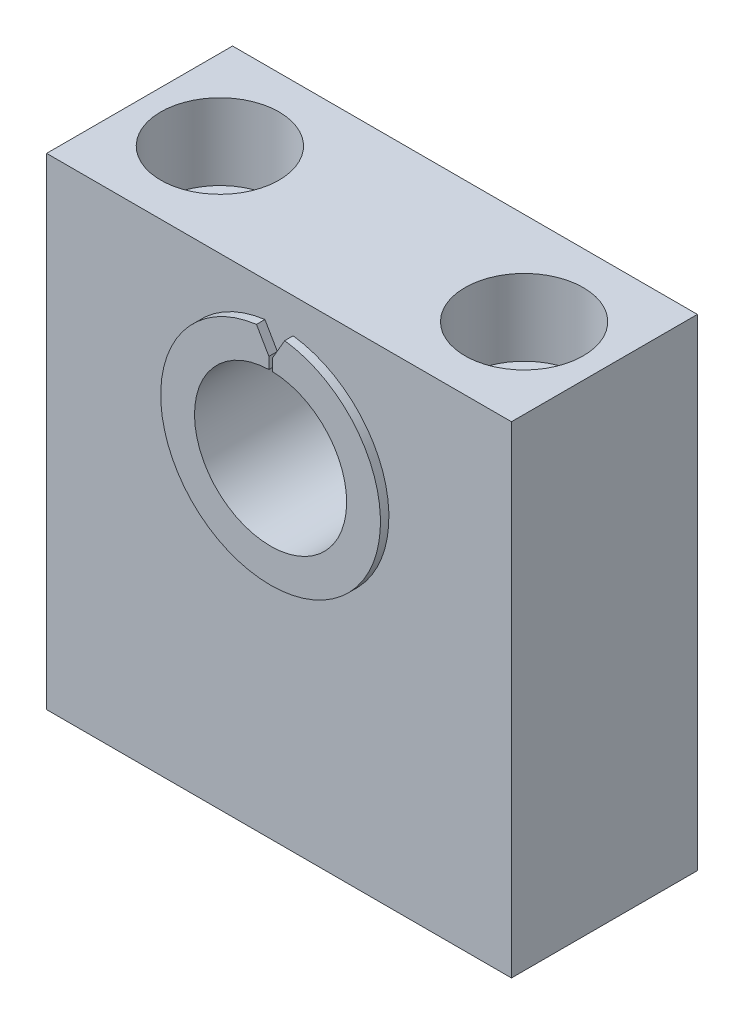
ISO-10303-21;
HEADER;
FILE_DESCRIPTION(('STEP AP214'),'2;1');
FILE_NAME('part.step','',(''),(''),'','','');
FILE_SCHEMA(('AUTOMOTIVE_DESIGN { 1 0 10303 214 1 1 1 1 }'));
ENDSEC;
DATA;
#1=APPLICATION_CONTEXT('core data for automotive mechanical design processes');
#2=APPLICATION_PROTOCOL_DEFINITION('international standard','automotive_design',2000,#1);
#3=PRODUCT_CONTEXT('',#1,'mechanical');
#4=PRODUCT('Part','Part','',(#3));
#5=PRODUCT_RELATED_PRODUCT_CATEGORY('part','',(#4));
#6=PRODUCT_DEFINITION_FORMATION('','',#4);
#7=PRODUCT_DEFINITION_CONTEXT('part definition',#1,'design');
#8=PRODUCT_DEFINITION('design','',#6,#7);
#9=PRODUCT_DEFINITION_SHAPE('','',#8);
#10=(LENGTH_UNIT() NAMED_UNIT(*) SI_UNIT(.MILLI.,.METRE.));
#11=(NAMED_UNIT(*) PLANE_ANGLE_UNIT() SI_UNIT($,.RADIAN.));
#12=(NAMED_UNIT(*) SI_UNIT($,.STERADIAN.) SOLID_ANGLE_UNIT());
#13=UNCERTAINTY_MEASURE_WITH_UNIT(LENGTH_MEASURE(1.E-05),#10,'distance_accuracy_value','');
#14=(GEOMETRIC_REPRESENTATION_CONTEXT(3) GLOBAL_UNCERTAINTY_ASSIGNED_CONTEXT((#13)) GLOBAL_UNIT_ASSIGNED_CONTEXT((#10,
#11,#12)) REPRESENTATION_CONTEXT('',''));
#15=CARTESIAN_POINT('',(0.,0.,0.));
#16=DIRECTION('',(0.,0.,1.));
#17=DIRECTION('',(1.,0.,0.));
#18=AXIS2_PLACEMENT_3D('',#15,#16,#17);
#19=CARTESIAN_POINT('',(0.,40.,-9.));
#20=DIRECTION('',(0.,0.,-1.));
#21=DIRECTION('',(0.,1.,0.));
#22=AXIS2_PLACEMENT_3D('',#19,#20,#21);
#23=CYLINDRICAL_SURFACE('',#22,9.);
#24=CARTESIAN_POINT('',(0.,40.,12.));
#25=DIRECTION('',(0.,0.,-1.));
#26=DIRECTION('',(1.,0.,0.));
#27=AXIS2_PLACEMENT_3D('',#24,#25,#26);
#28=CIRCLE('',#27,9.);
#29=CARTESIAN_POINT('',(0.200000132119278,48.9977775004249,12.));
#30=VERTEX_POINT('',#29);
#31=CARTESIAN_POINT('',(-0.200000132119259,48.9977775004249,12.));
#32=VERTEX_POINT('',#31);
#33=EDGE_CURVE('E289',#30,#32,#28,.T.);
#34=ORIENTED_EDGE('',*,*,#33,.F.);
#35=DIRECTION('',(0.,0.,1.));
#36=VECTOR('',#35,1.);
#37=CARTESIAN_POINT('',(0.20000000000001,48.9977775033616,-9.));
#38=LINE('',#37,#36);
#39=CARTESIAN_POINT('',(0.20000000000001,48.9977775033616,-9.));
#40=VERTEX_POINT('',#39);
#41=EDGE_CURVE('E322',#40,#30,#38,.T.);
#42=ORIENTED_EDGE('',*,*,#41,.F.);
#43=CARTESIAN_POINT('',(0.,40.,-9.));
#44=DIRECTION('',(0.,0.,-1.));
#45=DIRECTION('',(-1.,0.,0.));
#46=AXIS2_PLACEMENT_3D('',#43,#44,#45);
#47=CIRCLE('',#46,9.);
#48=CARTESIAN_POINT('',(-0.19999999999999,48.9977775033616,-9.));
#49=VERTEX_POINT('',#48);
#50=EDGE_CURVE('E377',#40,#49,#47,.T.);
#51=ORIENTED_EDGE('',*,*,#50,.T.);
#52=DIRECTION('',(0.,0.,-1.));
#53=VECTOR('',#52,1.);
#54=CARTESIAN_POINT('',(-0.19999999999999,48.9977775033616,-9.));
#55=LINE('',#54,#53);
#56=EDGE_CURVE('E320',#32,#49,#55,.T.);
#57=ORIENTED_EDGE('',*,*,#56,.F.);
#58=EDGE_LOOP('',(#34,#42,#51,#57));
#59=FACE_BOUND('',#58,.T.);
#60=ADVANCED_FACE('F14',(#59),#23,.F.);
#61=CARTESIAN_POINT('',(-0.199999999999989,50.346410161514,-9.));
#62=DIRECTION('',(-1.,0.,0.));
#63=DIRECTION('',(0.,0.,1.));
#64=AXIS2_PLACEMENT_3D('',#61,#62,#63);
#65=PLANE('',#64);
#66=DIRECTION('',(0.,0.,1.));
#67=VECTOR('',#66,1.);
#68=CARTESIAN_POINT('',(-0.199999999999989,49.99799979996,-9.));
#69=LINE('',#68,#67);
#70=CARTESIAN_POINT('',(-0.200000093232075,49.997999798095,-9.));
#71=VERTEX_POINT('',#70);
#72=CARTESIAN_POINT('',(-0.200000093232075,49.997999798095,11.));
#73=VERTEX_POINT('',#72);
#74=EDGE_CURVE('E221',#71,#73,#69,.T.);
#75=ORIENTED_EDGE('',*,*,#74,.T.);
#76=DIRECTION('',(-2.67592747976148E-07,-0.999999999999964,0.));
#77=VECTOR('',#76,1.);
#78=CARTESIAN_POINT('',(-0.199999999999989,50.346410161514,11.));
#79=LINE('',#78,#77);
#80=CARTESIAN_POINT('',(-0.199999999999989,50.346410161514,11.));
#81=VERTEX_POINT('',#80);
#82=EDGE_CURVE('E234',#81,#73,#79,.T.);
#83=ORIENTED_EDGE('',*,*,#82,.F.);
#84=DIRECTION('',(0.,0.,1.));
#85=VECTOR('',#84,1.);
#86=CARTESIAN_POINT('',(-0.199999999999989,50.346410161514,-9.));
#87=LINE('',#86,#85);
#88=CARTESIAN_POINT('',(-0.199999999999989,50.346410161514,12.));
#89=VERTEX_POINT('',#88);
#90=EDGE_CURVE('E293',#81,#89,#87,.T.);
#91=ORIENTED_EDGE('',*,*,#90,.T.);
#92=DIRECTION('',(0.,-1.,0.));
#93=VECTOR('',#92,1.);
#94=CARTESIAN_POINT('',(-0.199999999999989,50.346410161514,12.));
#95=LINE('',#94,#93);
#96=CARTESIAN_POINT('',(-0.199999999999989,49.4978945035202,12.));
#97=VERTEX_POINT('',#96);
#98=EDGE_CURVE('E286',#89,#97,#95,.T.);
#99=ORIENTED_EDGE('',*,*,#98,.T.);
#100=DIRECTION('',(7.46907448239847E-09,1.,0.));
#101=VECTOR('',#100,1.);
#102=CARTESIAN_POINT('',(-0.200000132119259,48.9977775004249,12.));
#103=LINE('',#102,#101);
#104=EDGE_CURVE('E283',#32,#97,#103,.T.);
#105=ORIENTED_EDGE('',*,*,#104,.F.);
#106=ORIENTED_EDGE('',*,*,#56,.T.);
#107=DIRECTION('',(0.,-1.,0.));
#108=VECTOR('',#107,1.);
#109=CARTESIAN_POINT('',(-0.199999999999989,50.346410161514,-9.));
#110=LINE('',#109,#108);
#111=CARTESIAN_POINT('',(-0.199999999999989,49.8159775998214,-9.));
#112=VERTEX_POINT('',#111);
#113=EDGE_CURVE('E326',#112,#49,#110,.T.);
#114=ORIENTED_EDGE('',*,*,#113,.F.);
#115=DIRECTION('',(-8.4392815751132E-08,-1.,0.));
#116=VECTOR('',#115,1.);
#117=CARTESIAN_POINT('',(-0.200000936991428,40.0000000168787,-9.));
#118=LINE('',#117,#116);
#119=EDGE_CURVE('E312',#71,#112,#118,.T.);
#120=ORIENTED_EDGE('',*,*,#119,.F.);
#121=EDGE_LOOP('',(#75,#83,#91,#99,#105,#106,#114,#120));
#122=FACE_BOUND('',#121,.T.);
#123=ADVANCED_FACE('F154',(#122),#65,.F.);
#124=CARTESIAN_POINT('',(0.2,40.,-9.));
#125=DIRECTION('',(1.,0.,0.));
#126=DIRECTION('',(0.,0.,-1.));
#127=AXIS2_PLACEMENT_3D('',#124,#125,#126);
#128=PLANE('',#127);
#129=DIRECTION('',(-2.67592741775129E-07,0.999999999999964,0.));
#130=VECTOR('',#129,1.);
#131=CARTESIAN_POINT('',(0.200000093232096,49.997999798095,11.));
#132=LINE('',#131,#130);
#133=CARTESIAN_POINT('',(0.200000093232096,49.997999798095,11.));
#134=VERTEX_POINT('',#133);
#135=CARTESIAN_POINT('',(0.200000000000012,50.346410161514,11.));
#136=VERTEX_POINT('',#135);
#137=EDGE_CURVE('E231',#134,#136,#132,.T.);
#138=ORIENTED_EDGE('',*,*,#137,.F.);
#139=DIRECTION('',(0.,0.,-1.));
#140=VECTOR('',#139,1.);
#141=CARTESIAN_POINT('',(0.200000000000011,49.99799979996,-9.));
#142=LINE('',#141,#140);
#143=CARTESIAN_POINT('',(0.200000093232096,49.997999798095,-9.));
#144=VERTEX_POINT('',#143);
#145=EDGE_CURVE('E225',#134,#144,#142,.T.);
#146=ORIENTED_EDGE('',*,*,#145,.T.);
#147=DIRECTION('',(-8.43928127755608E-08,1.,0.));
#148=VECTOR('',#147,1.);
#149=CARTESIAN_POINT('',(0.20000093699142,40.0000000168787,-9.));
#150=LINE('',#149,#148);
#151=CARTESIAN_POINT('',(0.200000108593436,49.8159775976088,-9.));
#152=VERTEX_POINT('',#151);
#153=EDGE_CURVE('E380',#152,#144,#150,.T.);
#154=ORIENTED_EDGE('',*,*,#153,.F.);
#155=DIRECTION('',(0.,1.,0.));
#156=VECTOR('',#155,1.);
#157=CARTESIAN_POINT('',(0.2,40.,-9.));
#158=LINE('',#157,#156);
#159=EDGE_CURVE('E331',#40,#152,#158,.T.);
#160=ORIENTED_EDGE('',*,*,#159,.F.);
#161=ORIENTED_EDGE('',*,*,#41,.T.);
#162=DIRECTION('',(7.46908699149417E-09,-1.,0.));
#163=VECTOR('',#162,1.);
#164=CARTESIAN_POINT('',(0.20000012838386,49.4978945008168,12.));
#165=LINE('',#164,#163);
#166=CARTESIAN_POINT('',(0.200000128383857,49.4978945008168,12.));
#167=VERTEX_POINT('',#166);
#168=EDGE_CURVE('E290',#167,#30,#165,.T.);
#169=ORIENTED_EDGE('',*,*,#168,.F.);
#170=DIRECTION('',(0.,1.,0.));
#171=VECTOR('',#170,1.);
#172=CARTESIAN_POINT('',(0.2,40.,12.));
#173=LINE('',#172,#171);
#174=CARTESIAN_POINT('',(0.200000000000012,50.346410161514,12.));
#175=VERTEX_POINT('',#174);
#176=EDGE_CURVE('E24',#167,#175,#173,.T.);
#177=ORIENTED_EDGE('',*,*,#176,.T.);
#178=DIRECTION('',(0.,0.,1.));
#179=VECTOR('',#178,1.);
#180=CARTESIAN_POINT('',(0.200000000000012,50.346410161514,-9.));
#181=LINE('',#180,#179);
#182=EDGE_CURVE('E309',#136,#175,#181,.T.);
#183=ORIENTED_EDGE('',*,*,#182,.F.);
#184=EDGE_LOOP('',(#138,#146,#154,#160,#161,#169,#177,#183));
#185=FACE_BOUND('',#184,.T.);
#186=ADVANCED_FACE('F160',(#185),#128,.F.);
#187=CARTESIAN_POINT('',(0.,49.3,-9.));
#188=DIRECTION('',(0.,0.,-1.));
#189=DIRECTION('',(-1.,0.,0.));
#190=AXIS2_PLACEMENT_3D('',#187,#188,#189);
#191=PLANE('',#190);
#192=ORIENTED_EDGE('',*,*,#159,.T.);
#193=ORIENTED_EDGE('',*,*,#153,.T.);
#194=CARTESIAN_POINT('',(0.,40.,-9.));
#195=DIRECTION('',(0.,0.,-1.));
#196=DIRECTION('',(-1.,0.,0.));
#197=AXIS2_PLACEMENT_3D('',#194,#195,#196);
#198=CIRCLE('',#197,10.);
#199=EDGE_CURVE('E387',#144,#71,#198,.T.);
#200=ORIENTED_EDGE('',*,*,#199,.T.);
#201=ORIENTED_EDGE('',*,*,#119,.T.);
#202=ORIENTED_EDGE('',*,*,#113,.T.);
#203=ORIENTED_EDGE('',*,*,#50,.F.);
#204=EDGE_LOOP('',(#192,#193,#200,#201,#202,#203));
#205=FACE_BOUND('',#204,.T.);
#206=ADVANCED_FACE('F166',(#205),#191,.T.);
#207=CARTESIAN_POINT('',(-1.93984108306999,53.359903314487,-9.));
#208=DIRECTION('',(-0.866025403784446,-0.499999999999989,0.));
#209=DIRECTION('',(-0.499999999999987,0.866025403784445,0.));
#210=AXIS2_PLACEMENT_3D('',#207,#208,#209);
#211=PLANE('',#210);
#212=DIRECTION('',(0.499999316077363,-0.866025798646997,0.));
#213=VECTOR('',#212,1.);
#214=CARTESIAN_POINT('',(-0.286419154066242,50.4960928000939,11.));
#215=LINE('',#214,#213);
#216=CARTESIAN_POINT('',(-0.286419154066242,50.4960928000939,11.));
#217=VERTEX_POINT('',#216);
#218=EDGE_CURVE('E105',#217,#81,#215,.T.);
#219=ORIENTED_EDGE('',*,*,#218,.F.);
#220=DIRECTION('',(-0.499999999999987,0.866025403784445,0.));
#221=VECTOR('',#220,1.);
#222=CARTESIAN_POINT('',(-0.216506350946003,50.375,11.));
#223=LINE('',#222,#221);
#224=CARTESIAN_POINT('',(-1.66987298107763,52.8923048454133,11.));
#225=VERTEX_POINT('',#224);
#226=EDGE_CURVE('E342',#217,#225,#223,.T.);
#227=ORIENTED_EDGE('',*,*,#226,.T.);
#228=DIRECTION('',(0.,0.,1.));
#229=VECTOR('',#228,1.);
#230=CARTESIAN_POINT('',(-1.66987298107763,52.8923048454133,-9.));
#231=LINE('',#230,#229);
#232=CARTESIAN_POINT('',(-1.66987298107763,52.8923048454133,12.));
#233=VERTEX_POINT('',#232);
#234=EDGE_CURVE('E355',#225,#233,#231,.T.);
#235=ORIENTED_EDGE('',*,*,#234,.T.);
#236=DIRECTION('',(0.499999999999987,-0.866025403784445,0.));
#237=VECTOR('',#236,1.);
#238=CARTESIAN_POINT('',(-1.93984108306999,53.359903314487,12.));
#239=LINE('',#238,#237);
#240=EDGE_CURVE('E294',#233,#89,#239,.T.);
#241=ORIENTED_EDGE('',*,*,#240,.T.);
#242=ORIENTED_EDGE('',*,*,#90,.F.);
#243=EDGE_LOOP('',(#219,#227,#235,#241,#242));
#244=FACE_BOUND('',#243,.T.);
#245=ADVANCED_FACE('F169',(#244),#211,.F.);
#246=CARTESIAN_POINT('',(0.,53.,12.));
#247=DIRECTION('',(0.,0.,1.));
#248=DIRECTION('',(1.,0.,0.));
#249=AXIS2_PLACEMENT_3D('',#246,#247,#248);
#250=PLANE('',#249);
#251=DIRECTION('',(0.499999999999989,0.866025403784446,0.));
#252=VECTOR('',#251,1.);
#253=CARTESIAN_POINT('',(0.200000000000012,50.346410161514,12.));
#254=LINE('',#253,#252);
#255=CARTESIAN_POINT('',(1.66987298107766,52.8923048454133,12.));
#256=VERTEX_POINT('',#255);
#257=EDGE_CURVE('E9',#175,#256,#254,.T.);
#258=ORIENTED_EDGE('',*,*,#257,.F.);
#259=ORIENTED_EDGE('',*,*,#176,.F.);
#260=ORIENTED_EDGE('',*,*,#168,.T.);
#261=ORIENTED_EDGE('',*,*,#33,.T.);
#262=ORIENTED_EDGE('',*,*,#104,.T.);
#263=ORIENTED_EDGE('',*,*,#98,.F.);
#264=ORIENTED_EDGE('',*,*,#240,.F.);
#265=CARTESIAN_POINT('',(0.,40.,12.));
#266=DIRECTION('',(0.,0.,-1.));
#267=DIRECTION('',(-1.,0.,0.));
#268=AXIS2_PLACEMENT_3D('',#265,#266,#267);
#269=CIRCLE('',#268,13.);
#270=EDGE_CURVE('E298',#256,#233,#269,.T.);
#271=ORIENTED_EDGE('',*,*,#270,.F.);
#272=EDGE_LOOP('',(#258,#259,#260,#261,#262,#263,#264,#271));
#273=FACE_BOUND('',#272,.T.);
#274=ADVANCED_FACE('F177',(#273),#250,.T.);
#275=CARTESIAN_POINT('',(0.200000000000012,50.346410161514,-9.));
#276=DIRECTION('',(0.866025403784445,-0.499999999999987,0.));
#277=DIRECTION('',(-0.499999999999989,-0.866025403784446,0.));
#278=AXIS2_PLACEMENT_3D('',#275,#276,#277);
#279=PLANE('',#278);
#280=DIRECTION('',(0.499999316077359,0.866025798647,0.));
#281=VECTOR('',#280,1.);
#282=CARTESIAN_POINT('',(0.200000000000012,50.346410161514,11.));
#283=LINE('',#282,#281);
#284=CARTESIAN_POINT('',(0.286419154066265,50.4960928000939,11.));
#285=VERTEX_POINT('',#284);
#286=EDGE_CURVE('E33',#136,#285,#283,.T.);
#287=ORIENTED_EDGE('',*,*,#286,.F.);
#288=ORIENTED_EDGE('',*,*,#182,.T.);
#289=ORIENTED_EDGE('',*,*,#257,.T.);
#290=DIRECTION('',(0.,0.,-1.));
#291=VECTOR('',#290,1.);
#292=CARTESIAN_POINT('',(1.66987298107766,52.8923048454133,-9.));
#293=LINE('',#292,#291);
#294=CARTESIAN_POINT('',(1.66987298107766,52.8923048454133,11.));
#295=VERTEX_POINT('',#294);
#296=EDGE_CURVE('E360',#256,#295,#293,.T.);
#297=ORIENTED_EDGE('',*,*,#296,.T.);
#298=DIRECTION('',(-0.499999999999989,-0.866025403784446,0.));
#299=VECTOR('',#298,1.);
#300=CARTESIAN_POINT('',(0.216506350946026,50.375,11.));
#301=LINE('',#300,#299);
#302=EDGE_CURVE('E346',#295,#285,#301,.T.);
#303=ORIENTED_EDGE('',*,*,#302,.T.);
#304=EDGE_LOOP('',(#287,#288,#289,#297,#303));
#305=FACE_BOUND('',#304,.T.);
#306=ADVANCED_FACE('F175',(#305),#279,.F.);
#307=CARTESIAN_POINT('',(0.,40.,-9.));
#308=DIRECTION('',(0.,0.,-1.));
#309=DIRECTION('',(0.,1.,0.));
#310=AXIS2_PLACEMENT_3D('',#307,#308,#309);
#311=CYLINDRICAL_SURFACE('',#310,13.);
#312=ORIENTED_EDGE('',*,*,#296,.F.);
#313=ORIENTED_EDGE('',*,*,#270,.T.);
#314=ORIENTED_EDGE('',*,*,#234,.F.);
#315=CARTESIAN_POINT('',(0.,40.,11.));
#316=DIRECTION('',(0.,0.,-1.));
#317=DIRECTION('',(-1.,0.,0.));
#318=AXIS2_PLACEMENT_3D('',#315,#316,#317);
#319=CIRCLE('',#318,13.);
#320=EDGE_CURVE('E350',#295,#225,#319,.T.);
#321=ORIENTED_EDGE('',*,*,#320,.F.);
#322=EDGE_LOOP('',(#312,#313,#314,#321));
#323=FACE_BOUND('',#322,.T.);
#324=ADVANCED_FACE('F171',(#323),#311,.T.);
#325=CARTESIAN_POINT('',(-18.,48.,0.));
#326=DIRECTION('',(0.,1.,0.));
#327=DIRECTION('',(0.,0.,-1.));
#328=AXIS2_PLACEMENT_3D('',#325,#326,#327);
#329=PLANE('',#328);
#330=CARTESIAN_POINT('',(-18.,48.,0.));
#331=DIRECTION('',(0.,1.,0.));
#332=DIRECTION('',(0.,0.,-1.));
#333=AXIS2_PLACEMENT_3D('',#330,#331,#332);
#334=CIRCLE('',#333,4.5);
#335=CARTESIAN_POINT('',(-18.,48.,-4.5));
#336=VERTEX_POINT('',#335);
#337=EDGE_CURVE('E106',#336,#336,#334,.T.);
#338=ORIENTED_EDGE('',*,*,#337,.F.);
#339=EDGE_LOOP('',(#338));
#340=FACE_BOUND('',#339,.T.);
#341=CARTESIAN_POINT('',(-18.,48.,0.));
#342=DIRECTION('',(0.,1.,0.));
#343=DIRECTION('',(0.,0.,-1.));
#344=AXIS2_PLACEMENT_3D('',#341,#342,#343);
#345=CIRCLE('',#344,7.);
#346=CARTESIAN_POINT('',(-18.,48.,-7.));
#347=VERTEX_POINT('',#346);
#348=EDGE_CURVE('E109',#347,#347,#345,.T.);
#349=ORIENTED_EDGE('',*,*,#348,.T.);
#350=EDGE_LOOP('',(#349));
#351=FACE_BOUND('',#350,.T.);
#352=ADVANCED_FACE('F174',(#340,#351),#329,.T.);
#353=CARTESIAN_POINT('',(18.,48.,0.));
#354=DIRECTION('',(0.,1.,0.));
#355=DIRECTION('',(0.,0.,-1.));
#356=AXIS2_PLACEMENT_3D('',#353,#354,#355);
#357=PLANE('',#356);
#358=CARTESIAN_POINT('',(18.,48.,0.));
#359=DIRECTION('',(0.,1.,0.));
#360=DIRECTION('',(0.,0.,-1.));
#361=AXIS2_PLACEMENT_3D('',#358,#359,#360);
#362=CIRCLE('',#361,4.5);
#363=CARTESIAN_POINT('',(18.,48.,-4.5));
#364=VERTEX_POINT('',#363);
#365=EDGE_CURVE('E18',#364,#364,#362,.T.);
#366=ORIENTED_EDGE('',*,*,#365,.F.);
#367=EDGE_LOOP('',(#366));
#368=FACE_BOUND('',#367,.T.);
#369=CARTESIAN_POINT('',(18.,48.,0.));
#370=DIRECTION('',(0.,1.,0.));
#371=DIRECTION('',(0.,0.,-1.));
#372=AXIS2_PLACEMENT_3D('',#369,#370,#371);
#373=CIRCLE('',#372,7.);
#374=CARTESIAN_POINT('',(18.,48.,-7.));
#375=VERTEX_POINT('',#374);
#376=EDGE_CURVE('E539',#375,#375,#373,.T.);
#377=ORIENTED_EDGE('',*,*,#376,.T.);
#378=EDGE_LOOP('',(#377));
#379=FACE_BOUND('',#378,.T.);
#380=ADVANCED_FACE('F181',(#368,#379),#357,.T.);
#381=CARTESIAN_POINT('',(-18.,48.,0.));
#382=DIRECTION('',(0.,1.,0.));
#383=DIRECTION('',(0.,0.,-1.));
#384=AXIS2_PLACEMENT_3D('',#381,#382,#383);
#385=CYLINDRICAL_SURFACE('',#384,7.);
#386=ORIENTED_EDGE('',*,*,#348,.F.);
#387=EDGE_LOOP('',(#386));
#388=FACE_BOUND('',#387,.T.);
#389=CARTESIAN_POINT('',(-18.,57.,0.));
#390=DIRECTION('',(0.,1.,0.));
#391=DIRECTION('',(0.,0.,-1.));
#392=AXIS2_PLACEMENT_3D('',#389,#390,#391);
#393=CIRCLE('',#392,7.);
#394=CARTESIAN_POINT('',(-18.,57.,-7.));
#395=VERTEX_POINT('',#394);
#396=EDGE_CURVE('E116',#395,#395,#393,.T.);
#397=ORIENTED_EDGE('',*,*,#396,.T.);
#398=EDGE_LOOP('',(#397));
#399=FACE_BOUND('',#398,.T.);
#400=ADVANCED_FACE('F184',(#388,#399),#385,.F.);
#401=CARTESIAN_POINT('',(18.,48.,0.));
#402=DIRECTION('',(0.,1.,0.));
#403=DIRECTION('',(0.,0.,-1.));
#404=AXIS2_PLACEMENT_3D('',#401,#402,#403);
#405=CYLINDRICAL_SURFACE('',#404,7.);
#406=ORIENTED_EDGE('',*,*,#376,.F.);
#407=EDGE_LOOP('',(#406));
#408=FACE_BOUND('',#407,.T.);
#409=CARTESIAN_POINT('',(18.,57.,0.));
#410=DIRECTION('',(0.,1.,0.));
#411=DIRECTION('',(0.,0.,-1.));
#412=AXIS2_PLACEMENT_3D('',#409,#410,#411);
#413=CIRCLE('',#412,7.);
#414=CARTESIAN_POINT('',(18.,57.,-7.));
#415=VERTEX_POINT('',#414);
#416=EDGE_CURVE('E123',#415,#415,#413,.T.);
#417=ORIENTED_EDGE('',*,*,#416,.T.);
#418=EDGE_LOOP('',(#417));
#419=FACE_BOUND('',#418,.T.);
#420=ADVANCED_FACE('F186',(#408,#419),#405,.F.);
#421=CARTESIAN_POINT('',(-18.,57.,0.));
#422=DIRECTION('',(0.,-1.,0.));
#423=DIRECTION('',(0.,0.,1.));
#424=AXIS2_PLACEMENT_3D('',#421,#422,#423);
#425=CYLINDRICAL_SURFACE('',#424,4.5);
#426=CARTESIAN_POINT('',(-18.,0.,0.));
#427=DIRECTION('',(0.,1.,0.));
#428=DIRECTION('',(0.,0.,-1.));
#429=AXIS2_PLACEMENT_3D('',#426,#427,#428);
#430=CIRCLE('',#429,4.5);
#431=CARTESIAN_POINT('',(-18.,0.,-4.5));
#432=VERTEX_POINT('',#431);
#433=EDGE_CURVE('E95',#432,#432,#430,.T.);
#434=ORIENTED_EDGE('',*,*,#433,.F.);
#435=EDGE_LOOP('',(#434));
#436=FACE_BOUND('',#435,.T.);
#437=ORIENTED_EDGE('',*,*,#337,.T.);
#438=EDGE_LOOP('',(#437));
#439=FACE_BOUND('',#438,.T.);
#440=ADVANCED_FACE('F189',(#436,#439),#425,.F.);
#441=CARTESIAN_POINT('',(18.,57.,0.));
#442=DIRECTION('',(0.,-1.,0.));
#443=DIRECTION('',(0.,0.,1.));
#444=AXIS2_PLACEMENT_3D('',#441,#442,#443);
#445=CYLINDRICAL_SURFACE('',#444,4.5);
#446=CARTESIAN_POINT('',(18.,0.,0.));
#447=DIRECTION('',(0.,1.,0.));
#448=DIRECTION('',(0.,0.,-1.));
#449=AXIS2_PLACEMENT_3D('',#446,#447,#448);
#450=CIRCLE('',#449,4.5);
#451=CARTESIAN_POINT('',(18.,0.,-4.5));
#452=VERTEX_POINT('',#451);
#453=EDGE_CURVE('E91',#452,#452,#450,.T.);
#454=ORIENTED_EDGE('',*,*,#453,.F.);
#455=EDGE_LOOP('',(#454));
#456=FACE_BOUND('',#455,.T.);
#457=ORIENTED_EDGE('',*,*,#365,.T.);
#458=EDGE_LOOP('',(#457));
#459=FACE_BOUND('',#458,.T.);
#460=ADVANCED_FACE('F203',(#456,#459),#445,.F.);
#461=CARTESIAN_POINT('',(-27.5,57.,-11.));
#462=DIRECTION('',(1.,0.,0.));
#463=DIRECTION('',(0.,0.,-1.));
#464=AXIS2_PLACEMENT_3D('',#461,#462,#463);
#465=PLANE('',#464);
#466=DIRECTION('',(0.,0.,1.));
#467=VECTOR('',#466,1.);
#468=CARTESIAN_POINT('',(-27.5,0.,-11.));
#469=LINE('',#468,#467);
#470=CARTESIAN_POINT('',(-27.5,0.,-11.));
#471=VERTEX_POINT('',#470);
#472=CARTESIAN_POINT('',(-27.5,0.,11.));
#473=VERTEX_POINT('',#472);
#474=EDGE_CURVE('E83',#471,#473,#469,.T.);
#475=ORIENTED_EDGE('',*,*,#474,.T.);
#476=DIRECTION('',(0.,-1.,0.));
#477=VECTOR('',#476,1.);
#478=CARTESIAN_POINT('',(-27.5,57.,11.));
#479=LINE('',#478,#477);
#480=CARTESIAN_POINT('',(-27.5,57.,11.));
#481=VERTEX_POINT('',#480);
#482=EDGE_CURVE('E104',#481,#473,#479,.T.);
#483=ORIENTED_EDGE('',*,*,#482,.F.);
#484=DIRECTION('',(0.,0.,1.));
#485=VECTOR('',#484,1.);
#486=CARTESIAN_POINT('',(-27.5,57.,-11.));
#487=LINE('',#486,#485);
#488=CARTESIAN_POINT('',(-27.5,57.,-11.));
#489=VERTEX_POINT('',#488);
#490=EDGE_CURVE('E78',#489,#481,#487,.T.);
#491=ORIENTED_EDGE('',*,*,#490,.F.);
#492=DIRECTION('',(0.,-1.,0.));
#493=VECTOR('',#492,1.);
#494=CARTESIAN_POINT('',(-27.5,57.,-11.));
#495=LINE('',#494,#493);
#496=EDGE_CURVE('E73',#489,#471,#495,.T.);
#497=ORIENTED_EDGE('',*,*,#496,.T.);
#498=EDGE_LOOP('',(#475,#483,#491,#497));
#499=FACE_BOUND('',#498,.T.);
#500=ADVANCED_FACE('F16',(#499),#465,.F.);
#501=CARTESIAN_POINT('',(0.,57.,0.));
#502=DIRECTION('',(0.,-1.,0.));
#503=DIRECTION('',(0.,0.,1.));
#504=AXIS2_PLACEMENT_3D('',#501,#502,#503);
#505=PLANE('',#504);
#506=ORIENTED_EDGE('',*,*,#416,.F.);
#507=EDGE_LOOP('',(#506));
#508=FACE_BOUND('',#507,.T.);
#509=ORIENTED_EDGE('',*,*,#396,.F.);
#510=EDGE_LOOP('',(#509));
#511=FACE_BOUND('',#510,.T.);
#512=ORIENTED_EDGE('',*,*,#490,.T.);
#513=DIRECTION('',(1.,0.,0.));
#514=VECTOR('',#513,1.);
#515=CARTESIAN_POINT('',(27.5,57.,11.));
#516=LINE('',#515,#514);
#517=CARTESIAN_POINT('',(27.5,57.,11.));
#518=VERTEX_POINT('',#517);
#519=EDGE_CURVE('E131',#481,#518,#516,.T.);
#520=ORIENTED_EDGE('',*,*,#519,.T.);
#521=DIRECTION('',(0.,0.,-1.));
#522=VECTOR('',#521,1.);
#523=CARTESIAN_POINT('',(27.5,57.,-11.));
#524=LINE('',#523,#522);
#525=CARTESIAN_POINT('',(27.5,57.,-11.));
#526=VERTEX_POINT('',#525);
#527=EDGE_CURVE('E132',#518,#526,#524,.T.);
#528=ORIENTED_EDGE('',*,*,#527,.T.);
#529=DIRECTION('',(-1.,0.,0.));
#530=VECTOR('',#529,1.);
#531=CARTESIAN_POINT('',(27.5,57.,-11.));
#532=LINE('',#531,#530);
#533=EDGE_CURVE('E85',#526,#489,#532,.T.);
#534=ORIENTED_EDGE('',*,*,#533,.T.);
#535=EDGE_LOOP('',(#512,#520,#528,#534));
#536=FACE_BOUND('',#535,.T.);
#537=ADVANCED_FACE('F135',(#508,#511,#536),#505,.F.);
#538=CARTESIAN_POINT('',(27.5,57.,-11.));
#539=DIRECTION('',(-1.,0.,0.));
#540=DIRECTION('',(0.,0.,1.));
#541=AXIS2_PLACEMENT_3D('',#538,#539,#540);
#542=PLANE('',#541);
#543=DIRECTION('',(0.,0.,-1.));
#544=VECTOR('',#543,1.);
#545=CARTESIAN_POINT('',(27.5,0.,-11.));
#546=LINE('',#545,#544);
#547=CARTESIAN_POINT('',(27.5,0.,11.));
#548=VERTEX_POINT('',#547);
#549=CARTESIAN_POINT('',(27.5,0.,-11.));
#550=VERTEX_POINT('',#549);
#551=EDGE_CURVE('E63',#548,#550,#546,.T.);
#552=ORIENTED_EDGE('',*,*,#551,.T.);
#553=DIRECTION('',(0.,-1.,0.));
#554=VECTOR('',#553,1.);
#555=CARTESIAN_POINT('',(27.5,57.,-11.));
#556=LINE('',#555,#554);
#557=EDGE_CURVE('E75',#526,#550,#556,.T.);
#558=ORIENTED_EDGE('',*,*,#557,.F.);
#559=ORIENTED_EDGE('',*,*,#527,.F.);
#560=DIRECTION('',(0.,-1.,0.));
#561=VECTOR('',#560,1.);
#562=CARTESIAN_POINT('',(27.5,57.,11.));
#563=LINE('',#562,#561);
#564=EDGE_CURVE('E102',#518,#548,#563,.T.);
#565=ORIENTED_EDGE('',*,*,#564,.T.);
#566=EDGE_LOOP('',(#552,#558,#559,#565));
#567=FACE_BOUND('',#566,.T.);
#568=ADVANCED_FACE('F140',(#567),#542,.F.);
#569=CARTESIAN_POINT('',(0.,0.,0.));
#570=DIRECTION('',(0.,-1.,0.));
#571=DIRECTION('',(0.,0.,1.));
#572=AXIS2_PLACEMENT_3D('',#569,#570,#571);
#573=PLANE('',#572);
#574=ORIENTED_EDGE('',*,*,#453,.T.);
#575=EDGE_LOOP('',(#574));
#576=FACE_BOUND('',#575,.T.);
#577=ORIENTED_EDGE('',*,*,#474,.F.);
#578=DIRECTION('',(-1.,0.,0.));
#579=VECTOR('',#578,1.);
#580=CARTESIAN_POINT('',(27.5,0.,-11.));
#581=LINE('',#580,#579);
#582=EDGE_CURVE('E69',#550,#471,#581,.T.);
#583=ORIENTED_EDGE('',*,*,#582,.F.);
#584=ORIENTED_EDGE('',*,*,#551,.F.);
#585=DIRECTION('',(1.,0.,0.));
#586=VECTOR('',#585,1.);
#587=CARTESIAN_POINT('',(27.5,0.,11.));
#588=LINE('',#587,#586);
#589=EDGE_CURVE('E89',#473,#548,#588,.T.);
#590=ORIENTED_EDGE('',*,*,#589,.F.);
#591=EDGE_LOOP('',(#577,#583,#584,#590));
#592=FACE_BOUND('',#591,.T.);
#593=ORIENTED_EDGE('',*,*,#433,.T.);
#594=EDGE_LOOP('',(#593));
#595=FACE_BOUND('',#594,.T.);
#596=ADVANCED_FACE('F87',(#576,#592,#595),#573,.T.);
#597=CARTESIAN_POINT('',(27.5,57.,11.));
#598=DIRECTION('',(0.,0.,-1.));
#599=DIRECTION('',(-1.,0.,0.));
#600=AXIS2_PLACEMENT_3D('',#597,#598,#599);
#601=PLANE('',#600);
#602=ORIENTED_EDGE('',*,*,#589,.T.);
#603=ORIENTED_EDGE('',*,*,#564,.F.);
#604=ORIENTED_EDGE('',*,*,#519,.F.);
#605=ORIENTED_EDGE('',*,*,#482,.T.);
#606=EDGE_LOOP('',(#602,#603,#604,#605));
#607=FACE_BOUND('',#606,.T.);
#608=ORIENTED_EDGE('',*,*,#218,.T.);
#609=ORIENTED_EDGE('',*,*,#82,.T.);
#610=CARTESIAN_POINT('',(0.,40.,11.));
#611=DIRECTION('',(0.,0.,-1.));
#612=DIRECTION('',(-1.,0.,0.));
#613=AXIS2_PLACEMENT_3D('',#610,#611,#612);
#614=CIRCLE('',#613,10.);
#615=EDGE_CURVE('E113',#73,#134,#614,.T.);
#616=ORIENTED_EDGE('',*,*,#615,.T.);
#617=ORIENTED_EDGE('',*,*,#137,.T.);
#618=ORIENTED_EDGE('',*,*,#286,.T.);
#619=ORIENTED_EDGE('',*,*,#302,.F.);
#620=ORIENTED_EDGE('',*,*,#320,.T.);
#621=ORIENTED_EDGE('',*,*,#226,.F.);
#622=EDGE_LOOP('',(#608,#609,#616,#617,#618,#619,#620,#621));
#623=FACE_BOUND('',#622,.T.);
#624=ADVANCED_FACE('F138',(#607,#623),#601,.F.);
#625=CARTESIAN_POINT('',(27.5,57.,-11.));
#626=DIRECTION('',(0.,0.,1.));
#627=DIRECTION('',(1.,0.,0.));
#628=AXIS2_PLACEMENT_3D('',#625,#626,#627);
#629=PLANE('',#628);
#630=CARTESIAN_POINT('',(0.,40.,-11.));
#631=DIRECTION('',(0.,0.,-1.));
#632=DIRECTION('',(-1.,0.,0.));
#633=AXIS2_PLACEMENT_3D('',#630,#631,#632);
#634=CIRCLE('',#633,10.);
#635=CARTESIAN_POINT('',(-10.,40.,-11.));
#636=VERTEX_POINT('',#635);
#637=EDGE_CURVE('E108',#636,#636,#634,.T.);
#638=ORIENTED_EDGE('',*,*,#637,.F.);
#639=EDGE_LOOP('',(#638));
#640=FACE_BOUND('',#639,.T.);
#641=ORIENTED_EDGE('',*,*,#582,.T.);
#642=ORIENTED_EDGE('',*,*,#496,.F.);
#643=ORIENTED_EDGE('',*,*,#533,.F.);
#644=ORIENTED_EDGE('',*,*,#557,.T.);
#645=EDGE_LOOP('',(#641,#642,#643,#644));
#646=FACE_BOUND('',#645,.T.);
#647=ADVANCED_FACE('F71',(#640,#646),#629,.F.);
#648=CARTESIAN_POINT('',(0.,40.,11.));
#649=DIRECTION('',(0.,0.,-1.));
#650=DIRECTION('',(-1.,0.,0.));
#651=AXIS2_PLACEMENT_3D('',#648,#649,#650);
#652=CYLINDRICAL_SURFACE('',#651,10.);
#653=ORIENTED_EDGE('',*,*,#637,.T.);
#654=EDGE_LOOP('',(#653));
#655=FACE_BOUND('',#654,.T.);
#656=ORIENTED_EDGE('',*,*,#615,.F.);
#657=ORIENTED_EDGE('',*,*,#74,.F.);
#658=ORIENTED_EDGE('',*,*,#199,.F.);
#659=ORIENTED_EDGE('',*,*,#145,.F.);
#660=EDGE_LOOP('',(#656,#657,#658,#659));
#661=FACE_BOUND('',#660,.T.);
#662=ADVANCED_FACE('F197',(#655,#661),#652,.F.);
#663=CLOSED_SHELL('',(#60,#123,#186,#206,#245,#274,#306,#324,#352,#380,#400,#420,#440,#460,#500,
#537,#568,#596,#624,#647,#662));
#664=MANIFOLD_SOLID_BREP('B1',#663);
#665=ADVANCED_BREP_SHAPE_REPRESENTATION('',(#18,#664),#14);
#666=SHAPE_DEFINITION_REPRESENTATION(#9,#665);
ENDSEC;
END-ISO-10303-21;
